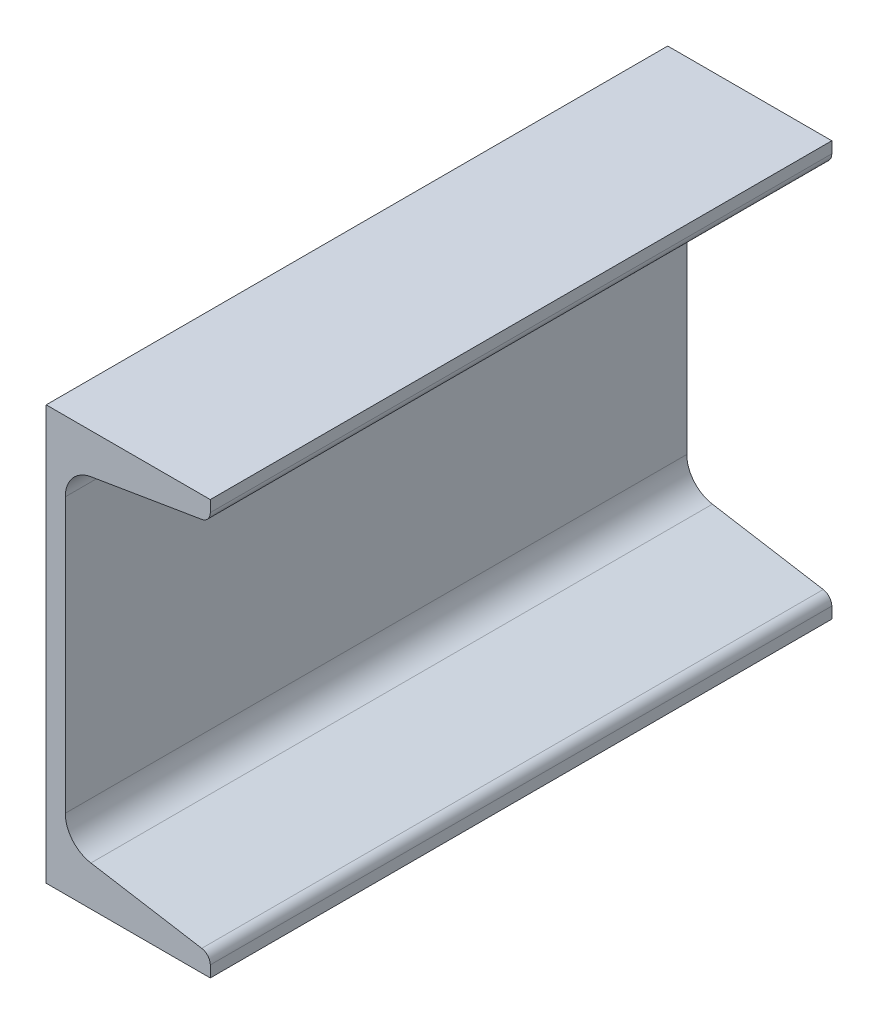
ISO-10303-21;
HEADER;
FILE_DESCRIPTION(('STEP AP214'),'2;1');
FILE_NAME('part.step','',(''),(''),'','','');
FILE_SCHEMA(('AUTOMOTIVE_DESIGN { 1 0 10303 214 1 1 1 1 }'));
ENDSEC;
DATA;
#1=APPLICATION_CONTEXT('core data for automotive mechanical design processes');
#2=APPLICATION_PROTOCOL_DEFINITION('international standard','automotive_design',2000,#1);
#3=PRODUCT_CONTEXT('',#1,'mechanical');
#4=PRODUCT('Part','Part','',(#3));
#5=PRODUCT_RELATED_PRODUCT_CATEGORY('part','',(#4));
#6=PRODUCT_DEFINITION_FORMATION('','',#4);
#7=PRODUCT_DEFINITION_CONTEXT('part definition',#1,'design');
#8=PRODUCT_DEFINITION('design','',#6,#7);
#9=PRODUCT_DEFINITION_SHAPE('','',#8);
#10=(LENGTH_UNIT() NAMED_UNIT(*) SI_UNIT(.MILLI.,.METRE.));
#11=(NAMED_UNIT(*) PLANE_ANGLE_UNIT() SI_UNIT($,.RADIAN.));
#12=(NAMED_UNIT(*) SI_UNIT($,.STERADIAN.) SOLID_ANGLE_UNIT());
#13=UNCERTAINTY_MEASURE_WITH_UNIT(LENGTH_MEASURE(1.E-05),#10,'distance_accuracy_value','');
#14=(GEOMETRIC_REPRESENTATION_CONTEXT(3) GLOBAL_UNCERTAINTY_ASSIGNED_CONTEXT((#13)) GLOBAL_UNIT_ASSIGNED_CONTEXT((#10,
#11,#12)) REPRESENTATION_CONTEXT('',''));
#15=CARTESIAN_POINT('',(0.,0.,0.));
#16=DIRECTION('',(0.,0.,1.));
#17=DIRECTION('',(1.,0.,0.));
#18=AXIS2_PLACEMENT_3D('',#15,#16,#17);
#19=CARTESIAN_POINT('',(40.2336,50.8,76.2));
#20=DIRECTION('',(1.,0.,0.));
#21=DIRECTION('',(0.,1.,0.));
#22=AXIS2_PLACEMENT_3D('',#19,#20,#21);
#23=PLANE('',#22);
#24=DIRECTION('',(0.,-1.,0.));
#25=VECTOR('',#24,1.);
#26=CARTESIAN_POINT('',(40.2336,50.8,-76.2));
#27=LINE('',#26,#25);
#28=CARTESIAN_POINT('',(40.2336,50.8,-76.2));
#29=VERTEX_POINT('',#28);
#30=CARTESIAN_POINT('',(40.2336,48.0188948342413,-76.2));
#31=VERTEX_POINT('',#30);
#32=EDGE_CURVE('E152',#29,#31,#27,.T.);
#33=ORIENTED_EDGE('',*,*,#32,.F.);
#34=DIRECTION('',(0.,0.,-1.));
#35=VECTOR('',#34,1.);
#36=CARTESIAN_POINT('',(40.2336,50.8,76.2));
#37=LINE('',#36,#35);
#38=CARTESIAN_POINT('',(40.2336,50.8,76.2));
#39=VERTEX_POINT('',#38);
#40=EDGE_CURVE('E11',#39,#29,#37,.T.);
#41=ORIENTED_EDGE('',*,*,#40,.F.);
#42=DIRECTION('',(0.,-1.,0.));
#43=VECTOR('',#42,1.);
#44=CARTESIAN_POINT('',(40.2336,50.8,76.2));
#45=LINE('',#44,#43);
#46=CARTESIAN_POINT('',(40.2336,48.0188948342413,76.2));
#47=VERTEX_POINT('',#46);
#48=EDGE_CURVE('E181',#39,#47,#45,.T.);
#49=ORIENTED_EDGE('',*,*,#48,.T.);
#50=DIRECTION('',(0.,0.,-1.));
#51=VECTOR('',#50,1.);
#52=CARTESIAN_POINT('',(40.2336,48.0188948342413,76.2));
#53=LINE('',#52,#51);
#54=EDGE_CURVE('E35',#47,#31,#53,.T.);
#55=ORIENTED_EDGE('',*,*,#54,.T.);
#56=EDGE_LOOP('',(#33,#41,#49,#55));
#57=FACE_BOUND('',#56,.T.);
#58=ADVANCED_FACE('F32',(#57),#23,.T.);
#59=CARTESIAN_POINT('',(40.2336,50.8,76.2));
#60=DIRECTION('',(0.,-1.,0.));
#61=DIRECTION('',(0.,0.,-1.));
#62=AXIS2_PLACEMENT_3D('',#59,#60,#61);
#63=PLANE('',#62);
#64=DIRECTION('',(-1.,0.,0.));
#65=VECTOR('',#64,1.);
#66=CARTESIAN_POINT('',(40.2336,50.8,-76.2));
#67=LINE('',#66,#65);
#68=CARTESIAN_POINT('',(0.,50.8,-76.2));
#69=VERTEX_POINT('',#68);
#70=EDGE_CURVE('E180',#29,#69,#67,.T.);
#71=ORIENTED_EDGE('',*,*,#70,.T.);
#72=DIRECTION('',(0.,0.,-1.));
#73=VECTOR('',#72,1.);
#74=CARTESIAN_POINT('',(0.,50.8,76.2));
#75=LINE('',#74,#73);
#76=CARTESIAN_POINT('',(0.,50.8,76.2));
#77=VERTEX_POINT('',#76);
#78=EDGE_CURVE('E41',#77,#69,#75,.T.);
#79=ORIENTED_EDGE('',*,*,#78,.F.);
#80=DIRECTION('',(-1.,0.,0.));
#81=VECTOR('',#80,1.);
#82=CARTESIAN_POINT('',(40.2336,50.8,76.2));
#83=LINE('',#82,#81);
#84=EDGE_CURVE('E147',#39,#77,#83,.T.);
#85=ORIENTED_EDGE('',*,*,#84,.F.);
#86=ORIENTED_EDGE('',*,*,#40,.T.);
#87=EDGE_LOOP('',(#71,#79,#85,#86));
#88=FACE_BOUND('',#87,.T.);
#89=ADVANCED_FACE('F203',(#88),#63,.F.);
#90=CARTESIAN_POINT('',(0.,-50.8,76.2));
#91=DIRECTION('',(-1.,0.,0.));
#92=DIRECTION('',(0.,0.,1.));
#93=AXIS2_PLACEMENT_3D('',#90,#91,#92);
#94=PLANE('',#93);
#95=DIRECTION('',(0.,1.,0.));
#96=VECTOR('',#95,1.);
#97=CARTESIAN_POINT('',(0.,-50.8,-76.2));
#98=LINE('',#97,#96);
#99=CARTESIAN_POINT('',(0.,-50.8,-76.2));
#100=VERTEX_POINT('',#99);
#101=EDGE_CURVE('E131',#100,#69,#98,.T.);
#102=ORIENTED_EDGE('',*,*,#101,.F.);
#103=DIRECTION('',(0.,0.,-1.));
#104=VECTOR('',#103,1.);
#105=CARTESIAN_POINT('',(0.,-50.8,76.2));
#106=LINE('',#105,#104);
#107=CARTESIAN_POINT('',(0.,-50.8,76.2));
#108=VERTEX_POINT('',#107);
#109=EDGE_CURVE('E125',#108,#100,#106,.T.);
#110=ORIENTED_EDGE('',*,*,#109,.F.);
#111=DIRECTION('',(0.,1.,0.));
#112=VECTOR('',#111,1.);
#113=CARTESIAN_POINT('',(0.,-50.8,76.2));
#114=LINE('',#113,#112);
#115=EDGE_CURVE('E129',#108,#77,#114,.T.);
#116=ORIENTED_EDGE('',*,*,#115,.T.);
#117=ORIENTED_EDGE('',*,*,#78,.T.);
#118=EDGE_LOOP('',(#102,#110,#116,#117));
#119=FACE_BOUND('',#118,.T.);
#120=ADVANCED_FACE('F127',(#119),#94,.T.);
#121=CARTESIAN_POINT('',(0.,-50.8,76.2));
#122=DIRECTION('',(0.,1.,0.));
#123=DIRECTION('',(-1.,0.,0.));
#124=AXIS2_PLACEMENT_3D('',#121,#122,#123);
#125=PLANE('',#124);
#126=DIRECTION('',(1.,0.,0.));
#127=VECTOR('',#126,1.);
#128=CARTESIAN_POINT('',(0.,-50.8,-76.2));
#129=LINE('',#128,#127);
#130=CARTESIAN_POINT('',(40.2336,-50.8,-76.2));
#131=VERTEX_POINT('',#130);
#132=EDGE_CURVE('E177',#100,#131,#129,.T.);
#133=ORIENTED_EDGE('',*,*,#132,.T.);
#134=DIRECTION('',(0.,0.,-1.));
#135=VECTOR('',#134,1.);
#136=CARTESIAN_POINT('',(40.2336,-50.8,76.2));
#137=LINE('',#136,#135);
#138=CARTESIAN_POINT('',(40.2336,-50.8,76.2));
#139=VERTEX_POINT('',#138);
#140=EDGE_CURVE('E135',#139,#131,#137,.T.);
#141=ORIENTED_EDGE('',*,*,#140,.F.);
#142=DIRECTION('',(1.,0.,0.));
#143=VECTOR('',#142,1.);
#144=CARTESIAN_POINT('',(0.,-50.8,76.2));
#145=LINE('',#144,#143);
#146=EDGE_CURVE('E138',#108,#139,#145,.T.);
#147=ORIENTED_EDGE('',*,*,#146,.F.);
#148=ORIENTED_EDGE('',*,*,#109,.T.);
#149=EDGE_LOOP('',(#133,#141,#147,#148));
#150=FACE_BOUND('',#149,.T.);
#151=ADVANCED_FACE('F139',(#150),#125,.F.);
#152=CARTESIAN_POINT('',(40.2336,-48.0188948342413,76.2));
#153=DIRECTION('',(1.,0.,0.));
#154=DIRECTION('',(0.,1.,0.));
#155=AXIS2_PLACEMENT_3D('',#152,#153,#154);
#156=PLANE('',#155);
#157=DIRECTION('',(0.,-1.,0.));
#158=VECTOR('',#157,1.);
#159=CARTESIAN_POINT('',(40.2336,-48.0188948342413,-76.2));
#160=LINE('',#159,#158);
#161=CARTESIAN_POINT('',(40.2336,-48.0188948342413,-76.2));
#162=VERTEX_POINT('',#161);
#163=EDGE_CURVE('E174',#162,#131,#160,.T.);
#164=ORIENTED_EDGE('',*,*,#163,.F.);
#165=DIRECTION('',(0.,0.,-1.));
#166=VECTOR('',#165,1.);
#167=CARTESIAN_POINT('',(40.2336,-48.0188948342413,76.2));
#168=LINE('',#167,#166);
#169=CARTESIAN_POINT('',(40.2336,-48.0188948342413,76.2));
#170=VERTEX_POINT('',#169);
#171=EDGE_CURVE('E185',#170,#162,#168,.T.);
#172=ORIENTED_EDGE('',*,*,#171,.F.);
#173=DIRECTION('',(0.,-1.,0.));
#174=VECTOR('',#173,1.);
#175=CARTESIAN_POINT('',(40.2336,-48.0188948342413,76.2));
#176=LINE('',#175,#174);
#177=EDGE_CURVE('E143',#170,#139,#176,.T.);
#178=ORIENTED_EDGE('',*,*,#177,.T.);
#179=ORIENTED_EDGE('',*,*,#140,.T.);
#180=EDGE_LOOP('',(#164,#172,#178,#179));
#181=FACE_BOUND('',#180,.T.);
#182=ADVANCED_FACE('F225',(#181),#156,.T.);
#183=CARTESIAN_POINT('',(37.7274666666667,-48.0188948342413,76.2));
#184=DIRECTION('',(0.,0.,-1.));
#185=DIRECTION('',(-1.,0.,0.));
#186=AXIS2_PLACEMENT_3D('',#183,#184,#185);
#187=CYLINDRICAL_SURFACE('',#186,2.50613333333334);
#188=CARTESIAN_POINT('',(37.7274666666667,-48.0188948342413,-76.2));
#189=DIRECTION('',(0.,0.,1.));
#190=DIRECTION('',(1.,0.,0.));
#191=AXIS2_PLACEMENT_3D('',#188,#189,#190);
#192=CIRCLE('',#191,2.50613333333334);
#193=CARTESIAN_POINT('',(38.139467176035,-45.5468592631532,-76.2));
#194=VERTEX_POINT('',#193);
#195=EDGE_CURVE('E172',#162,#194,#192,.T.);
#196=ORIENTED_EDGE('',*,*,#195,.T.);
#197=DIRECTION('',(0.,0.,-1.));
#198=VECTOR('',#197,1.);
#199=CARTESIAN_POINT('',(38.139467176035,-45.5468592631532,76.2));
#200=LINE('',#199,#198);
#201=CARTESIAN_POINT('',(38.139467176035,-45.5468592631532,76.2));
#202=VERTEX_POINT('',#201);
#203=EDGE_CURVE('E187',#202,#194,#200,.T.);
#204=ORIENTED_EDGE('',*,*,#203,.F.);
#205=CARTESIAN_POINT('',(37.7274666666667,-48.0188948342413,76.2));
#206=DIRECTION('',(0.,0.,1.));
#207=DIRECTION('',(1.,0.,0.));
#208=AXIS2_PLACEMENT_3D('',#205,#206,#207);
#209=CIRCLE('',#208,2.50613333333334);
#210=EDGE_CURVE('E222',#170,#202,#209,.T.);
#211=ORIENTED_EDGE('',*,*,#210,.F.);
#212=ORIENTED_EDGE('',*,*,#171,.T.);
#213=EDGE_LOOP('',(#196,#204,#211,#212));
#214=FACE_BOUND('',#213,.T.);
#215=ADVANCED_FACE('F231',(#214),#187,.T.);
#216=CARTESIAN_POINT('',(38.139467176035,-45.5468592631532,76.2));
#217=DIRECTION('',(-0.164396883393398,-0.986394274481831,0.));
#218=DIRECTION('',(0.986394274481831,-0.164396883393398,0.));
#219=AXIS2_PLACEMENT_3D('',#216,#217,#218);
#220=PLANE('',#219);
#221=DIRECTION('',(-0.986394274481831,0.164396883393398,0.));
#222=VECTOR('',#221,1.);
#223=CARTESIAN_POINT('',(38.139467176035,-45.5468592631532,-76.2));
#224=LINE('',#223,#222);
#225=CARTESIAN_POINT('',(10.9559984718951,-41.0163407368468,-76.2));
#226=VERTEX_POINT('',#225);
#227=EDGE_CURVE('E170',#194,#226,#224,.T.);
#228=ORIENTED_EDGE('',*,*,#227,.T.);
#229=DIRECTION('',(0.,0.,-1.));
#230=VECTOR('',#229,1.);
#231=CARTESIAN_POINT('',(10.9559984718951,-41.0163407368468,76.2));
#232=LINE('',#231,#230);
#233=CARTESIAN_POINT('',(10.9559984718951,-41.0163407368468,76.2));
#234=VERTEX_POINT('',#233);
#235=EDGE_CURVE('E190',#234,#226,#232,.T.);
#236=ORIENTED_EDGE('',*,*,#235,.F.);
#237=DIRECTION('',(-0.986394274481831,0.164396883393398,0.));
#238=VECTOR('',#237,1.);
#239=CARTESIAN_POINT('',(38.139467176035,-45.5468592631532,76.2));
#240=LINE('',#239,#238);
#241=EDGE_CURVE('E220',#202,#234,#240,.T.);
#242=ORIENTED_EDGE('',*,*,#241,.F.);
#243=ORIENTED_EDGE('',*,*,#203,.T.);
#244=EDGE_LOOP('',(#228,#236,#242,#243));
#245=FACE_BOUND('',#244,.T.);
#246=ADVANCED_FACE('F235',(#245),#220,.F.);
#247=CARTESIAN_POINT('',(12.192,-33.6002340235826,76.2));
#248=DIRECTION('',(0.,0.,-1.));
#249=DIRECTION('',(-1.,0.,0.));
#250=AXIS2_PLACEMENT_3D('',#247,#248,#249);
#251=CYLINDRICAL_SURFACE('',#250,7.5184);
#252=CARTESIAN_POINT('',(12.192,-33.6002340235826,-76.2));
#253=DIRECTION('',(0.,0.,-1.));
#254=DIRECTION('',(-1.,0.,0.));
#255=AXIS2_PLACEMENT_3D('',#252,#253,#254);
#256=CIRCLE('',#255,7.5184);
#257=CARTESIAN_POINT('',(4.6736,-33.6002340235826,-76.2));
#258=VERTEX_POINT('',#257);
#259=EDGE_CURVE('E167',#226,#258,#256,.T.);
#260=ORIENTED_EDGE('',*,*,#259,.T.);
#261=DIRECTION('',(0.,0.,-1.));
#262=VECTOR('',#261,1.);
#263=CARTESIAN_POINT('',(4.6736,-33.6002340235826,76.2));
#264=LINE('',#263,#262);
#265=CARTESIAN_POINT('',(4.6736,-33.6002340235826,76.2));
#266=VERTEX_POINT('',#265);
#267=EDGE_CURVE('E193',#266,#258,#264,.T.);
#268=ORIENTED_EDGE('',*,*,#267,.F.);
#269=CARTESIAN_POINT('',(12.192,-33.6002340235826,76.2));
#270=DIRECTION('',(0.,0.,-1.));
#271=DIRECTION('',(-1.,0.,0.));
#272=AXIS2_PLACEMENT_3D('',#269,#270,#271);
#273=CIRCLE('',#272,7.5184);
#274=EDGE_CURVE('E218',#234,#266,#273,.T.);
#275=ORIENTED_EDGE('',*,*,#274,.F.);
#276=ORIENTED_EDGE('',*,*,#235,.T.);
#277=EDGE_LOOP('',(#260,#268,#275,#276));
#278=FACE_BOUND('',#277,.T.);
#279=ADVANCED_FACE('F240',(#278),#251,.F.);
#280=CARTESIAN_POINT('',(4.6736,33.6002340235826,76.2));
#281=DIRECTION('',(1.,0.,0.));
#282=DIRECTION('',(0.,0.,-1.));
#283=AXIS2_PLACEMENT_3D('',#280,#281,#282);
#284=PLANE('',#283);
#285=DIRECTION('',(0.,-1.,0.));
#286=VECTOR('',#285,1.);
#287=CARTESIAN_POINT('',(4.6736,33.6002340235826,-76.2));
#288=LINE('',#287,#286);
#289=CARTESIAN_POINT('',(4.6736,33.6002340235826,-76.2));
#290=VERTEX_POINT('',#289);
#291=EDGE_CURVE('E164',#290,#258,#288,.T.);
#292=ORIENTED_EDGE('',*,*,#291,.F.);
#293=DIRECTION('',(0.,0.,-1.));
#294=VECTOR('',#293,1.);
#295=CARTESIAN_POINT('',(4.6736,33.6002340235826,76.2));
#296=LINE('',#295,#294);
#297=CARTESIAN_POINT('',(4.6736,33.6002340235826,76.2));
#298=VERTEX_POINT('',#297);
#299=EDGE_CURVE('E195',#298,#290,#296,.T.);
#300=ORIENTED_EDGE('',*,*,#299,.F.);
#301=DIRECTION('',(0.,-1.,0.));
#302=VECTOR('',#301,1.);
#303=CARTESIAN_POINT('',(4.6736,33.6002340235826,76.2));
#304=LINE('',#303,#302);
#305=EDGE_CURVE('E215',#298,#266,#304,.T.);
#306=ORIENTED_EDGE('',*,*,#305,.T.);
#307=ORIENTED_EDGE('',*,*,#267,.T.);
#308=EDGE_LOOP('',(#292,#300,#306,#307));
#309=FACE_BOUND('',#308,.T.);
#310=ADVANCED_FACE('F250',(#309),#284,.T.);
#311=CARTESIAN_POINT('',(12.192,33.6002340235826,76.2));
#312=DIRECTION('',(0.,0.,-1.));
#313=DIRECTION('',(-1.,0.,0.));
#314=AXIS2_PLACEMENT_3D('',#311,#312,#313);
#315=CYLINDRICAL_SURFACE('',#314,7.5184);
#316=CARTESIAN_POINT('',(12.192,33.6002340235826,-76.2));
#317=DIRECTION('',(0.,0.,1.));
#318=DIRECTION('',(1.,0.,0.));
#319=AXIS2_PLACEMENT_3D('',#316,#317,#318);
#320=CIRCLE('',#319,7.5184);
#321=CARTESIAN_POINT('',(10.9559984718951,41.0163407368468,-76.2));
#322=VERTEX_POINT('',#321);
#323=EDGE_CURVE('E161',#322,#290,#320,.T.);
#324=ORIENTED_EDGE('',*,*,#323,.F.);
#325=DIRECTION('',(0.,0.,-1.));
#326=VECTOR('',#325,1.);
#327=CARTESIAN_POINT('',(10.9559984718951,41.0163407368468,76.2));
#328=LINE('',#327,#326);
#329=CARTESIAN_POINT('',(10.9559984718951,41.0163407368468,76.2));
#330=VERTEX_POINT('',#329);
#331=EDGE_CURVE('E197',#330,#322,#328,.T.);
#332=ORIENTED_EDGE('',*,*,#331,.F.);
#333=CARTESIAN_POINT('',(12.192,33.6002340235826,76.2));
#334=DIRECTION('',(0.,0.,1.));
#335=DIRECTION('',(1.,0.,0.));
#336=AXIS2_PLACEMENT_3D('',#333,#334,#335);
#337=CIRCLE('',#336,7.5184);
#338=EDGE_CURVE('E212',#330,#298,#337,.T.);
#339=ORIENTED_EDGE('',*,*,#338,.T.);
#340=ORIENTED_EDGE('',*,*,#299,.T.);
#341=EDGE_LOOP('',(#324,#332,#339,#340));
#342=FACE_BOUND('',#341,.T.);
#343=ADVANCED_FACE('F246',(#342),#315,.F.);
#344=CARTESIAN_POINT('',(38.139467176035,45.5468592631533,76.2));
#345=DIRECTION('',(0.164396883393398,-0.986394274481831,0.));
#346=DIRECTION('',(0.986394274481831,0.164396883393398,0.));
#347=AXIS2_PLACEMENT_3D('',#344,#345,#346);
#348=PLANE('',#347);
#349=DIRECTION('',(-0.986394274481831,-0.164396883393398,0.));
#350=VECTOR('',#349,1.);
#351=CARTESIAN_POINT('',(38.139467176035,45.5468592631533,-76.2));
#352=LINE('',#351,#350);
#353=CARTESIAN_POINT('',(38.139467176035,45.5468592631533,-76.2));
#354=VERTEX_POINT('',#353);
#355=EDGE_CURVE('E158',#354,#322,#352,.T.);
#356=ORIENTED_EDGE('',*,*,#355,.F.);
#357=DIRECTION('',(0.,0.,-1.));
#358=VECTOR('',#357,1.);
#359=CARTESIAN_POINT('',(38.139467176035,45.5468592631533,76.2));
#360=LINE('',#359,#358);
#361=CARTESIAN_POINT('',(38.139467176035,45.5468592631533,76.2));
#362=VERTEX_POINT('',#361);
#363=EDGE_CURVE('E198',#362,#354,#360,.T.);
#364=ORIENTED_EDGE('',*,*,#363,.F.);
#365=DIRECTION('',(-0.986394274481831,-0.164396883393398,0.));
#366=VECTOR('',#365,1.);
#367=CARTESIAN_POINT('',(38.139467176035,45.5468592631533,76.2));
#368=LINE('',#367,#366);
#369=EDGE_CURVE('E207',#362,#330,#368,.T.);
#370=ORIENTED_EDGE('',*,*,#369,.T.);
#371=ORIENTED_EDGE('',*,*,#331,.T.);
#372=EDGE_LOOP('',(#356,#364,#370,#371));
#373=FACE_BOUND('',#372,.T.);
#374=ADVANCED_FACE('F249',(#373),#348,.T.);
#375=CARTESIAN_POINT('',(37.7274666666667,48.0188948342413,76.2));
#376=DIRECTION('',(0.,0.,-1.));
#377=DIRECTION('',(-1.,0.,0.));
#378=AXIS2_PLACEMENT_3D('',#375,#376,#377);
#379=CYLINDRICAL_SURFACE('',#378,2.50613333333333);
#380=CARTESIAN_POINT('',(37.7274666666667,48.0188948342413,-76.2));
#381=DIRECTION('',(0.,0.,-1.));
#382=DIRECTION('',(-1.,0.,0.));
#383=AXIS2_PLACEMENT_3D('',#380,#381,#382);
#384=CIRCLE('',#383,2.50613333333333);
#385=EDGE_CURVE('E155',#31,#354,#384,.T.);
#386=ORIENTED_EDGE('',*,*,#385,.F.);
#387=ORIENTED_EDGE('',*,*,#54,.F.);
#388=CARTESIAN_POINT('',(37.7274666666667,48.0188948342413,76.2));
#389=DIRECTION('',(0.,0.,-1.));
#390=DIRECTION('',(-1.,0.,0.));
#391=AXIS2_PLACEMENT_3D('',#388,#389,#390);
#392=CIRCLE('',#391,2.50613333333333);
#393=EDGE_CURVE('E205',#47,#362,#392,.T.);
#394=ORIENTED_EDGE('',*,*,#393,.T.);
#395=ORIENTED_EDGE('',*,*,#363,.T.);
#396=EDGE_LOOP('',(#386,#387,#394,#395));
#397=FACE_BOUND('',#396,.T.);
#398=ADVANCED_FACE('F200',(#397),#379,.T.);
#399=CARTESIAN_POINT('',(37.7274666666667,48.0188948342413,76.2));
#400=DIRECTION('',(0.,0.,-1.));
#401=DIRECTION('',(-1.,0.,0.));
#402=AXIS2_PLACEMENT_3D('',#399,#400,#401);
#403=PLANE('',#402);
#404=ORIENTED_EDGE('',*,*,#48,.F.);
#405=ORIENTED_EDGE('',*,*,#84,.T.);
#406=ORIENTED_EDGE('',*,*,#115,.F.);
#407=ORIENTED_EDGE('',*,*,#146,.T.);
#408=ORIENTED_EDGE('',*,*,#177,.F.);
#409=ORIENTED_EDGE('',*,*,#210,.T.);
#410=ORIENTED_EDGE('',*,*,#241,.T.);
#411=ORIENTED_EDGE('',*,*,#274,.T.);
#412=ORIENTED_EDGE('',*,*,#305,.F.);
#413=ORIENTED_EDGE('',*,*,#338,.F.);
#414=ORIENTED_EDGE('',*,*,#369,.F.);
#415=ORIENTED_EDGE('',*,*,#393,.F.);
#416=EDGE_LOOP('',(#404,#405,#406,#407,#408,#409,#410,#411,#412,#413,#414,#415));
#417=FACE_BOUND('',#416,.T.);
#418=ADVANCED_FACE('F146',(#417),#403,.F.);
#419=CARTESIAN_POINT('',(37.7274666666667,48.0188948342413,-76.2));
#420=DIRECTION('',(0.,0.,-1.));
#421=DIRECTION('',(-1.,0.,0.));
#422=AXIS2_PLACEMENT_3D('',#419,#420,#421);
#423=PLANE('',#422);
#424=ORIENTED_EDGE('',*,*,#32,.T.);
#425=ORIENTED_EDGE('',*,*,#385,.T.);
#426=ORIENTED_EDGE('',*,*,#355,.T.);
#427=ORIENTED_EDGE('',*,*,#323,.T.);
#428=ORIENTED_EDGE('',*,*,#291,.T.);
#429=ORIENTED_EDGE('',*,*,#259,.F.);
#430=ORIENTED_EDGE('',*,*,#227,.F.);
#431=ORIENTED_EDGE('',*,*,#195,.F.);
#432=ORIENTED_EDGE('',*,*,#163,.T.);
#433=ORIENTED_EDGE('',*,*,#132,.F.);
#434=ORIENTED_EDGE('',*,*,#101,.T.);
#435=ORIENTED_EDGE('',*,*,#70,.F.);
#436=EDGE_LOOP('',(#424,#425,#426,#427,#428,#429,#430,#431,#432,#433,#434,#435));
#437=FACE_BOUND('',#436,.T.);
#438=ADVANCED_FACE('F202',(#437),#423,.T.);
#439=CLOSED_SHELL('',(#58,#89,#120,#151,#182,#215,#246,#279,#310,#343,#374,#398,#418,#438));
#440=MANIFOLD_SOLID_BREP('B2',#439);
#441=ADVANCED_BREP_SHAPE_REPRESENTATION('',(#18,#440),#14);
#442=SHAPE_DEFINITION_REPRESENTATION(#9,#441);
ENDSEC;
END-ISO-10303-21;
